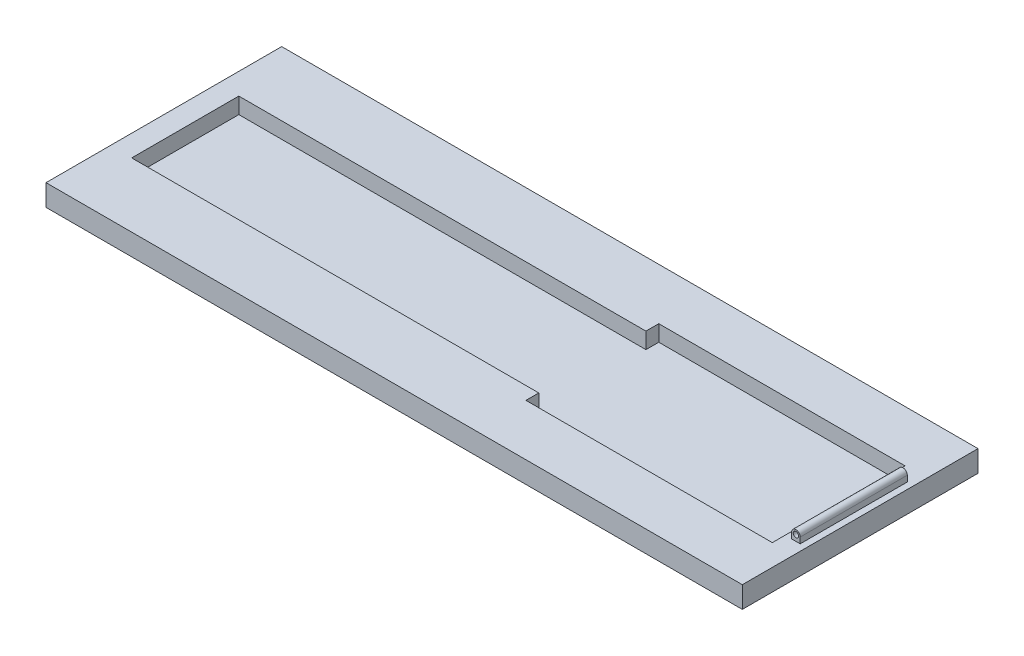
ISO-10303-21;
HEADER;
FILE_DESCRIPTION(('STEP AP214'),'2;1');
FILE_NAME('part.step','',(''),(''),'','','');
FILE_SCHEMA(('AUTOMOTIVE_DESIGN { 1 0 10303 214 1 1 1 1 }'));
ENDSEC;
DATA;
#1=APPLICATION_CONTEXT('core data for automotive mechanical design processes');
#2=APPLICATION_PROTOCOL_DEFINITION('international standard','automotive_design',2000,#1);
#3=PRODUCT_CONTEXT('',#1,'mechanical');
#4=PRODUCT('Part','Part','',(#3));
#5=PRODUCT_RELATED_PRODUCT_CATEGORY('part','',(#4));
#6=PRODUCT_DEFINITION_FORMATION('','',#4);
#7=PRODUCT_DEFINITION_CONTEXT('part definition',#1,'design');
#8=PRODUCT_DEFINITION('design','',#6,#7);
#9=PRODUCT_DEFINITION_SHAPE('','',#8);
#10=(LENGTH_UNIT() NAMED_UNIT(*) SI_UNIT(.MILLI.,.METRE.));
#11=(NAMED_UNIT(*) PLANE_ANGLE_UNIT() SI_UNIT($,.RADIAN.));
#12=(NAMED_UNIT(*) SI_UNIT($,.STERADIAN.) SOLID_ANGLE_UNIT());
#13=UNCERTAINTY_MEASURE_WITH_UNIT(LENGTH_MEASURE(1.E-05),#10,'distance_accuracy_value','');
#14=(GEOMETRIC_REPRESENTATION_CONTEXT(3) GLOBAL_UNCERTAINTY_ASSIGNED_CONTEXT((#13)) GLOBAL_UNIT_ASSIGNED_CONTEXT((#10,
#11,#12)) REPRESENTATION_CONTEXT('',''));
#15=CARTESIAN_POINT('',(0.,0.,0.));
#16=DIRECTION('',(0.,0.,1.));
#17=DIRECTION('',(1.,0.,0.));
#18=AXIS2_PLACEMENT_3D('',#15,#16,#17);
#19=CARTESIAN_POINT('',(-6400.,-55.,1100.));
#20=DIRECTION('',(0.,-1.,0.));
#21=DIRECTION('',(0.,0.,-1.));
#22=AXIS2_PLACEMENT_3D('',#19,#20,#21);
#23=PLANE('',#22);
#24=DIRECTION('',(-1.,0.,0.));
#25=VECTOR('',#24,1.);
#26=CARTESIAN_POINT('',(-2400.,-55.,-500.));
#27=LINE('',#26,#25);
#28=CARTESIAN_POINT('',(-2400.,-55.,-500.));
#29=VERTEX_POINT('',#28);
#30=CARTESIAN_POINT('',(-6200.,-55.,-500.));
#31=VERTEX_POINT('',#30);
#32=EDGE_CURVE('E191',#29,#31,#27,.T.);
#33=ORIENTED_EDGE('',*,*,#32,.F.);
#34=DIRECTION('',(0.,0.,1.));
#35=VECTOR('',#34,1.);
#36=CARTESIAN_POINT('',(-2400.,-55.,-620.));
#37=LINE('',#36,#35);
#38=CARTESIAN_POINT('',(-2400.,-55.,-620.));
#39=VERTEX_POINT('',#38);
#40=EDGE_CURVE('E52',#39,#29,#37,.T.);
#41=ORIENTED_EDGE('',*,*,#40,.F.);
#42=DIRECTION('',(-1.,0.,0.));
#43=VECTOR('',#42,1.);
#44=CARTESIAN_POINT('',(-2400.,-55.,-620.));
#45=LINE('',#44,#43);
#46=CARTESIAN_POINT('',(-100.,-55.,-620.));
#47=VERTEX_POINT('',#46);
#48=EDGE_CURVE('E171',#47,#39,#45,.T.);
#49=ORIENTED_EDGE('',*,*,#48,.F.);
#50=DIRECTION('',(0.,0.,-1.));
#51=VECTOR('',#50,1.);
#52=CARTESIAN_POINT('',(-100.,-55.,-620.));
#53=LINE('',#52,#51);
#54=CARTESIAN_POINT('',(-100.,-55.,620.));
#55=VERTEX_POINT('',#54);
#56=EDGE_CURVE('E174',#55,#47,#53,.T.);
#57=ORIENTED_EDGE('',*,*,#56,.F.);
#58=DIRECTION('',(1.,0.,0.));
#59=VECTOR('',#58,1.);
#60=CARTESIAN_POINT('',(-2400.,-55.,620.));
#61=LINE('',#60,#59);
#62=CARTESIAN_POINT('',(-2400.,-55.,620.));
#63=VERTEX_POINT('',#62);
#64=EDGE_CURVE('E202',#63,#55,#61,.T.);
#65=ORIENTED_EDGE('',*,*,#64,.F.);
#66=DIRECTION('',(0.,0.,1.));
#67=VECTOR('',#66,1.);
#68=CARTESIAN_POINT('',(-2400.,-55.,500.));
#69=LINE('',#68,#67);
#70=CARTESIAN_POINT('',(-2400.,-55.,500.));
#71=VERTEX_POINT('',#70);
#72=EDGE_CURVE('E199',#71,#63,#69,.T.);
#73=ORIENTED_EDGE('',*,*,#72,.F.);
#74=DIRECTION('',(1.,0.,0.));
#75=VECTOR('',#74,1.);
#76=CARTESIAN_POINT('',(-2400.,-55.,500.));
#77=LINE('',#76,#75);
#78=CARTESIAN_POINT('',(-6200.,-55.,500.000000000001));
#79=VERTEX_POINT('',#78);
#80=EDGE_CURVE('E196',#79,#71,#77,.T.);
#81=ORIENTED_EDGE('',*,*,#80,.F.);
#82=DIRECTION('',(0.,0.,1.));
#83=VECTOR('',#82,1.);
#84=CARTESIAN_POINT('',(-6200.,-55.,-500.));
#85=LINE('',#84,#83);
#86=EDGE_CURVE('E193',#31,#79,#85,.T.);
#87=ORIENTED_EDGE('',*,*,#86,.F.);
#88=EDGE_LOOP('',(#33,#41,#49,#57,#65,#73,#81,#87));
#89=FACE_BOUND('',#88,.T.);
#90=DIRECTION('',(-1.,0.,0.));
#91=VECTOR('',#90,1.);
#92=CARTESIAN_POINT('',(-6400.,-55.,-1100.));
#93=LINE('',#92,#91);
#94=CARTESIAN_POINT('',(100.,-55.,-1100.));
#95=VERTEX_POINT('',#94);
#96=CARTESIAN_POINT('',(-6400.,-55.,-1100.));
#97=VERTEX_POINT('',#96);
#98=EDGE_CURVE('E260',#95,#97,#93,.T.);
#99=ORIENTED_EDGE('',*,*,#98,.T.);
#100=DIRECTION('',(0.,0.,-1.));
#101=VECTOR('',#100,1.);
#102=CARTESIAN_POINT('',(-6400.,-55.,1100.));
#103=LINE('',#102,#101);
#104=CARTESIAN_POINT('',(-6400.,-55.,1100.));
#105=VERTEX_POINT('',#104);
#106=EDGE_CURVE('E266',#105,#97,#103,.T.);
#107=ORIENTED_EDGE('',*,*,#106,.F.);
#108=DIRECTION('',(-1.,0.,0.));
#109=VECTOR('',#108,1.);
#110=CARTESIAN_POINT('',(-6400.,-55.,1100.));
#111=LINE('',#110,#109);
#112=CARTESIAN_POINT('',(100.,-55.,1100.));
#113=VERTEX_POINT('',#112);
#114=EDGE_CURVE('E264',#113,#105,#111,.T.);
#115=ORIENTED_EDGE('',*,*,#114,.F.);
#116=DIRECTION('',(0.,0.,-1.));
#117=VECTOR('',#116,1.);
#118=CARTESIAN_POINT('',(100.,-55.,1100.));
#119=LINE('',#118,#117);
#120=EDGE_CURVE('E276',#113,#95,#119,.T.);
#121=ORIENTED_EDGE('',*,*,#120,.T.);
#122=EDGE_LOOP('',(#99,#107,#115,#121));
#123=FACE_BOUND('',#122,.T.);
#124=DIRECTION('',(0.,0.,-1.));
#125=VECTOR('',#124,1.);
#126=CARTESIAN_POINT('',(-40.,-55.,500.));
#127=LINE('',#126,#125);
#128=CARTESIAN_POINT('',(-40.,-55.,500.));
#129=VERTEX_POINT('',#128);
#130=CARTESIAN_POINT('',(-40.,-55.,-500.));
#131=VERTEX_POINT('',#130);
#132=EDGE_CURVE('E250',#129,#131,#127,.T.);
#133=ORIENTED_EDGE('',*,*,#132,.T.);
#134=DIRECTION('',(1.,0.,0.));
#135=VECTOR('',#134,1.);
#136=CARTESIAN_POINT('',(-40.,-55.,-500.));
#137=LINE('',#136,#135);
#138=CARTESIAN_POINT('',(40.,-55.,-500.));
#139=VERTEX_POINT('',#138);
#140=EDGE_CURVE('E242',#131,#139,#137,.T.);
#141=ORIENTED_EDGE('',*,*,#140,.T.);
#142=DIRECTION('',(0.,0.,-1.));
#143=VECTOR('',#142,1.);
#144=CARTESIAN_POINT('',(40.,-55.,500.));
#145=LINE('',#144,#143);
#146=CARTESIAN_POINT('',(40.,-55.,500.));
#147=VERTEX_POINT('',#146);
#148=EDGE_CURVE('E247',#147,#139,#145,.T.);
#149=ORIENTED_EDGE('',*,*,#148,.F.);
#150=DIRECTION('',(1.,0.,0.));
#151=VECTOR('',#150,1.);
#152=CARTESIAN_POINT('',(-40.,-55.,500.));
#153=LINE('',#152,#151);
#154=EDGE_CURVE('E60',#129,#147,#153,.T.);
#155=ORIENTED_EDGE('',*,*,#154,.F.);
#156=EDGE_LOOP('',(#133,#141,#149,#155));
#157=FACE_BOUND('',#156,.T.);
#158=ADVANCED_FACE('F37',(#89,#123,#157),#23,.F.);
#159=CARTESIAN_POINT('',(-6400.,-55.,1100.));
#160=DIRECTION('',(1.,0.,0.));
#161=DIRECTION('',(0.,0.,-1.));
#162=AXIS2_PLACEMENT_3D('',#159,#160,#161);
#163=PLANE('',#162);
#164=DIRECTION('',(0.,-1.,0.));
#165=VECTOR('',#164,1.);
#166=CARTESIAN_POINT('',(-6400.,-55.,-1100.));
#167=LINE('',#166,#165);
#168=CARTESIAN_POINT('',(-6400.,-255.,-1100.));
#169=VERTEX_POINT('',#168);
#170=EDGE_CURVE('E255',#97,#169,#167,.T.);
#171=ORIENTED_EDGE('',*,*,#170,.T.);
#172=DIRECTION('',(0.,0.,-1.));
#173=VECTOR('',#172,1.);
#174=CARTESIAN_POINT('',(-6400.,-255.,1100.));
#175=LINE('',#174,#173);
#176=CARTESIAN_POINT('',(-6400.,-255.,1100.));
#177=VERTEX_POINT('',#176);
#178=EDGE_CURVE('E11',#177,#169,#175,.T.);
#179=ORIENTED_EDGE('',*,*,#178,.F.);
#180=DIRECTION('',(0.,-1.,0.));
#181=VECTOR('',#180,1.);
#182=CARTESIAN_POINT('',(-6400.,-55.,1100.));
#183=LINE('',#182,#181);
#184=EDGE_CURVE('E256',#105,#177,#183,.T.);
#185=ORIENTED_EDGE('',*,*,#184,.F.);
#186=ORIENTED_EDGE('',*,*,#106,.T.);
#187=EDGE_LOOP('',(#171,#179,#185,#186));
#188=FACE_BOUND('',#187,.T.);
#189=ADVANCED_FACE('F39',(#188),#163,.F.);
#190=CARTESIAN_POINT('',(-6400.,-255.,1100.));
#191=DIRECTION('',(0.,1.,0.));
#192=DIRECTION('',(0.,0.,1.));
#193=AXIS2_PLACEMENT_3D('',#190,#191,#192);
#194=PLANE('',#193);
#195=DIRECTION('',(1.,0.,0.));
#196=VECTOR('',#195,1.);
#197=CARTESIAN_POINT('',(-6400.,-255.,-1100.));
#198=LINE('',#197,#196);
#199=CARTESIAN_POINT('',(100.,-255.,-1100.));
#200=VERTEX_POINT('',#199);
#201=EDGE_CURVE('E269',#169,#200,#198,.T.);
#202=ORIENTED_EDGE('',*,*,#201,.T.);
#203=DIRECTION('',(0.,0.,-1.));
#204=VECTOR('',#203,1.);
#205=CARTESIAN_POINT('',(100.,-255.,1100.));
#206=LINE('',#205,#204);
#207=CARTESIAN_POINT('',(100.,-255.,1100.));
#208=VERTEX_POINT('',#207);
#209=EDGE_CURVE('E45',#208,#200,#206,.T.);
#210=ORIENTED_EDGE('',*,*,#209,.F.);
#211=DIRECTION('',(1.,0.,0.));
#212=VECTOR('',#211,1.);
#213=CARTESIAN_POINT('',(-6400.,-255.,1100.));
#214=LINE('',#213,#212);
#215=EDGE_CURVE('E259',#177,#208,#214,.T.);
#216=ORIENTED_EDGE('',*,*,#215,.F.);
#217=ORIENTED_EDGE('',*,*,#178,.T.);
#218=EDGE_LOOP('',(#202,#210,#216,#217));
#219=FACE_BOUND('',#218,.T.);
#220=ADVANCED_FACE('F298',(#219),#194,.F.);
#221=CARTESIAN_POINT('',(100.,-55.,1100.));
#222=DIRECTION('',(-1.,0.,0.));
#223=DIRECTION('',(0.,-1.,0.));
#224=AXIS2_PLACEMENT_3D('',#221,#222,#223);
#225=PLANE('',#224);
#226=DIRECTION('',(0.,1.,0.));
#227=VECTOR('',#226,1.);
#228=CARTESIAN_POINT('',(100.,-55.,-1100.));
#229=LINE('',#228,#227);
#230=EDGE_CURVE('E271',#200,#95,#229,.T.);
#231=ORIENTED_EDGE('',*,*,#230,.T.);
#232=ORIENTED_EDGE('',*,*,#120,.F.);
#233=DIRECTION('',(0.,1.,0.));
#234=VECTOR('',#233,1.);
#235=CARTESIAN_POINT('',(100.,-55.,1100.));
#236=LINE('',#235,#234);
#237=EDGE_CURVE('E262',#208,#113,#236,.T.);
#238=ORIENTED_EDGE('',*,*,#237,.F.);
#239=ORIENTED_EDGE('',*,*,#209,.T.);
#240=EDGE_LOOP('',(#231,#232,#238,#239));
#241=FACE_BOUND('',#240,.T.);
#242=ADVANCED_FACE('F283',(#241),#225,.F.);
#243=CARTESIAN_POINT('',(-6400.,-255.,1100.));
#244=DIRECTION('',(0.,0.,1.));
#245=DIRECTION('',(1.,0.,0.));
#246=AXIS2_PLACEMENT_3D('',#243,#244,#245);
#247=PLANE('',#246);
#248=ORIENTED_EDGE('',*,*,#184,.T.);
#249=ORIENTED_EDGE('',*,*,#215,.T.);
#250=ORIENTED_EDGE('',*,*,#237,.T.);
#251=ORIENTED_EDGE('',*,*,#114,.T.);
#252=EDGE_LOOP('',(#248,#249,#250,#251));
#253=FACE_BOUND('',#252,.T.);
#254=ADVANCED_FACE('F297',(#253),#247,.T.);
#255=CARTESIAN_POINT('',(-6400.,-255.,-1100.));
#256=DIRECTION('',(0.,0.,1.));
#257=DIRECTION('',(1.,0.,0.));
#258=AXIS2_PLACEMENT_3D('',#255,#256,#257);
#259=PLANE('',#258);
#260=ORIENTED_EDGE('',*,*,#170,.F.);
#261=ORIENTED_EDGE('',*,*,#98,.F.);
#262=ORIENTED_EDGE('',*,*,#230,.F.);
#263=ORIENTED_EDGE('',*,*,#201,.F.);
#264=EDGE_LOOP('',(#260,#261,#262,#263));
#265=FACE_BOUND('',#264,.T.);
#266=ADVANCED_FACE('F289',(#265),#259,.F.);
#267=CARTESIAN_POINT('',(0.,0.,500.));
#268=DIRECTION('',(0.,0.,1.));
#269=DIRECTION('',(1.,0.,0.));
#270=AXIS2_PLACEMENT_3D('',#267,#268,#269);
#271=PLANE('',#270);
#272=CARTESIAN_POINT('',(0.,0.,500.));
#273=DIRECTION('',(0.,0.,1.));
#274=DIRECTION('',(1.,0.,0.));
#275=AXIS2_PLACEMENT_3D('',#272,#273,#274);
#276=CIRCLE('',#275,40.);
#277=CARTESIAN_POINT('',(40.,0.,500.));
#278=VERTEX_POINT('',#277);
#279=CARTESIAN_POINT('',(-40.,0.,500.));
#280=VERTEX_POINT('',#279);
#281=EDGE_CURVE('E227',#278,#280,#276,.T.);
#282=ORIENTED_EDGE('',*,*,#281,.T.);
#283=DIRECTION('',(0.,-1.,0.));
#284=VECTOR('',#283,1.);
#285=CARTESIAN_POINT('',(-40.,0.,500.));
#286=LINE('',#285,#284);
#287=EDGE_CURVE('E230',#280,#129,#286,.T.);
#288=ORIENTED_EDGE('',*,*,#287,.T.);
#289=ORIENTED_EDGE('',*,*,#154,.T.);
#290=DIRECTION('',(0.,1.,0.));
#291=VECTOR('',#290,1.);
#292=CARTESIAN_POINT('',(40.,-55.,500.));
#293=LINE('',#292,#291);
#294=EDGE_CURVE('E234',#147,#278,#293,.T.);
#295=ORIENTED_EDGE('',*,*,#294,.T.);
#296=EDGE_LOOP('',(#282,#288,#289,#295));
#297=FACE_BOUND('',#296,.T.);
#298=CARTESIAN_POINT('',(0.,0.,500.));
#299=DIRECTION('',(0.,0.,1.));
#300=DIRECTION('',(1.,0.,0.));
#301=AXIS2_PLACEMENT_3D('',#298,#299,#300);
#302=CIRCLE('',#301,25.);
#303=CARTESIAN_POINT('',(25.,0.,500.));
#304=VERTEX_POINT('',#303);
#305=EDGE_CURVE('E221',#304,#304,#302,.T.);
#306=ORIENTED_EDGE('',*,*,#305,.F.);
#307=EDGE_LOOP('',(#306));
#308=FACE_BOUND('',#307,.T.);
#309=ADVANCED_FACE('F313',(#297,#308),#271,.T.);
#310=CARTESIAN_POINT('',(0.,0.,-500.));
#311=DIRECTION('',(0.,0.,1.));
#312=DIRECTION('',(1.,0.,0.));
#313=AXIS2_PLACEMENT_3D('',#310,#311,#312);
#314=PLANE('',#313);
#315=CARTESIAN_POINT('',(0.,0.,-500.));
#316=DIRECTION('',(0.,0.,1.));
#317=DIRECTION('',(1.,0.,0.));
#318=AXIS2_PLACEMENT_3D('',#315,#316,#317);
#319=CIRCLE('',#318,40.);
#320=CARTESIAN_POINT('',(40.,0.,-500.));
#321=VERTEX_POINT('',#320);
#322=CARTESIAN_POINT('',(-40.,0.,-500.));
#323=VERTEX_POINT('',#322);
#324=EDGE_CURVE('E224',#321,#323,#319,.T.);
#325=ORIENTED_EDGE('',*,*,#324,.F.);
#326=DIRECTION('',(0.,1.,0.));
#327=VECTOR('',#326,1.);
#328=CARTESIAN_POINT('',(40.,-55.,-500.));
#329=LINE('',#328,#327);
#330=EDGE_CURVE('E231',#139,#321,#329,.T.);
#331=ORIENTED_EDGE('',*,*,#330,.F.);
#332=ORIENTED_EDGE('',*,*,#140,.F.);
#333=DIRECTION('',(0.,-1.,0.));
#334=VECTOR('',#333,1.);
#335=CARTESIAN_POINT('',(-40.,0.,-500.));
#336=LINE('',#335,#334);
#337=EDGE_CURVE('E239',#323,#131,#336,.T.);
#338=ORIENTED_EDGE('',*,*,#337,.F.);
#339=EDGE_LOOP('',(#325,#331,#332,#338));
#340=FACE_BOUND('',#339,.T.);
#341=CARTESIAN_POINT('',(0.,0.,-500.));
#342=DIRECTION('',(0.,0.,1.));
#343=DIRECTION('',(1.,0.,0.));
#344=AXIS2_PLACEMENT_3D('',#341,#342,#343);
#345=CIRCLE('',#344,25.);
#346=CARTESIAN_POINT('',(25.,0.,-500.));
#347=VERTEX_POINT('',#346);
#348=EDGE_CURVE('E209',#347,#347,#345,.T.);
#349=ORIENTED_EDGE('',*,*,#348,.T.);
#350=EDGE_LOOP('',(#349));
#351=FACE_BOUND('',#350,.T.);
#352=ADVANCED_FACE('F320',(#340,#351),#314,.F.);
#353=CARTESIAN_POINT('',(0.,0.,500.));
#354=DIRECTION('',(0.,0.,-1.));
#355=DIRECTION('',(-1.,0.,0.));
#356=AXIS2_PLACEMENT_3D('',#353,#354,#355);
#357=CYLINDRICAL_SURFACE('',#356,40.);
#358=ORIENTED_EDGE('',*,*,#324,.T.);
#359=DIRECTION('',(0.,0.,-1.));
#360=VECTOR('',#359,1.);
#361=CARTESIAN_POINT('',(-40.,0.,500.));
#362=LINE('',#361,#360);
#363=EDGE_CURVE('E252',#280,#323,#362,.T.);
#364=ORIENTED_EDGE('',*,*,#363,.F.);
#365=ORIENTED_EDGE('',*,*,#281,.F.);
#366=DIRECTION('',(0.,0.,-1.));
#367=VECTOR('',#366,1.);
#368=CARTESIAN_POINT('',(40.,0.,500.));
#369=LINE('',#368,#367);
#370=EDGE_CURVE('E236',#278,#321,#369,.T.);
#371=ORIENTED_EDGE('',*,*,#370,.T.);
#372=EDGE_LOOP('',(#358,#364,#365,#371));
#373=FACE_BOUND('',#372,.T.);
#374=ADVANCED_FACE('F316',(#373),#357,.T.);
#375=CARTESIAN_POINT('',(-40.,0.,500.));
#376=DIRECTION('',(1.,0.,0.));
#377=DIRECTION('',(0.,1.,0.));
#378=AXIS2_PLACEMENT_3D('',#375,#376,#377);
#379=PLANE('',#378);
#380=ORIENTED_EDGE('',*,*,#337,.T.);
#381=ORIENTED_EDGE('',*,*,#132,.F.);
#382=ORIENTED_EDGE('',*,*,#287,.F.);
#383=ORIENTED_EDGE('',*,*,#363,.T.);
#384=EDGE_LOOP('',(#380,#381,#382,#383));
#385=FACE_BOUND('',#384,.T.);
#386=ADVANCED_FACE('F319',(#385),#379,.F.);
#387=CARTESIAN_POINT('',(40.,-55.,500.));
#388=DIRECTION('',(-1.,0.,0.));
#389=DIRECTION('',(0.,0.,1.));
#390=AXIS2_PLACEMENT_3D('',#387,#388,#389);
#391=PLANE('',#390);
#392=ORIENTED_EDGE('',*,*,#330,.T.);
#393=ORIENTED_EDGE('',*,*,#370,.F.);
#394=ORIENTED_EDGE('',*,*,#294,.F.);
#395=ORIENTED_EDGE('',*,*,#148,.T.);
#396=EDGE_LOOP('',(#392,#393,#394,#395));
#397=FACE_BOUND('',#396,.T.);
#398=ADVANCED_FACE('F324',(#397),#391,.F.);
#399=CARTESIAN_POINT('',(0.,0.,500.));
#400=DIRECTION('',(0.,0.,-1.));
#401=DIRECTION('',(-1.,0.,0.));
#402=AXIS2_PLACEMENT_3D('',#399,#400,#401);
#403=CYLINDRICAL_SURFACE('',#402,25.);
#404=ORIENTED_EDGE('',*,*,#305,.T.);
#405=EDGE_LOOP('',(#404));
#406=FACE_BOUND('',#405,.T.);
#407=ORIENTED_EDGE('',*,*,#348,.F.);
#408=EDGE_LOOP('',(#407));
#409=FACE_BOUND('',#408,.T.);
#410=ADVANCED_FACE('F328',(#406,#409),#403,.F.);
#411=CARTESIAN_POINT('',(-2400.,-205.,-620.));
#412=DIRECTION('',(-1.,0.,0.));
#413=DIRECTION('',(0.,0.,1.));
#414=AXIS2_PLACEMENT_3D('',#411,#412,#413);
#415=PLANE('',#414);
#416=ORIENTED_EDGE('',*,*,#40,.T.);
#417=DIRECTION('',(0.,1.,0.));
#418=VECTOR('',#417,1.);
#419=CARTESIAN_POINT('',(-2400.,-205.,-500.));
#420=LINE('',#419,#418);
#421=CARTESIAN_POINT('',(-2400.,-205.,-500.));
#422=VERTEX_POINT('',#421);
#423=EDGE_CURVE('E148',#422,#29,#420,.T.);
#424=ORIENTED_EDGE('',*,*,#423,.F.);
#425=DIRECTION('',(0.,0.,1.));
#426=VECTOR('',#425,1.);
#427=CARTESIAN_POINT('',(-2400.,-205.,-620.));
#428=LINE('',#427,#426);
#429=CARTESIAN_POINT('',(-2400.,-205.,-620.));
#430=VERTEX_POINT('',#429);
#431=EDGE_CURVE('E152',#430,#422,#428,.T.);
#432=ORIENTED_EDGE('',*,*,#431,.F.);
#433=DIRECTION('',(0.,1.,0.));
#434=VECTOR('',#433,1.);
#435=CARTESIAN_POINT('',(-2400.,-205.,-620.));
#436=LINE('',#435,#434);
#437=EDGE_CURVE('E207',#430,#39,#436,.T.);
#438=ORIENTED_EDGE('',*,*,#437,.T.);
#439=EDGE_LOOP('',(#416,#424,#432,#438));
#440=FACE_BOUND('',#439,.T.);
#441=ADVANCED_FACE('F150',(#440),#415,.F.);
#442=CARTESIAN_POINT('',(-2400.,-205.,-620.));
#443=DIRECTION('',(0.,0.,-1.));
#444=DIRECTION('',(-1.,0.,0.));
#445=AXIS2_PLACEMENT_3D('',#442,#443,#444);
#446=PLANE('',#445);
#447=ORIENTED_EDGE('',*,*,#48,.T.);
#448=ORIENTED_EDGE('',*,*,#437,.F.);
#449=DIRECTION('',(-1.,0.,0.));
#450=VECTOR('',#449,1.);
#451=CARTESIAN_POINT('',(-2400.,-205.,-620.));
#452=LINE('',#451,#450);
#453=CARTESIAN_POINT('',(-100.,-205.,-620.));
#454=VERTEX_POINT('',#453);
#455=EDGE_CURVE('E158',#454,#430,#452,.T.);
#456=ORIENTED_EDGE('',*,*,#455,.F.);
#457=DIRECTION('',(0.,1.,0.));
#458=VECTOR('',#457,1.);
#459=CARTESIAN_POINT('',(-100.,-205.,-620.));
#460=LINE('',#459,#458);
#461=EDGE_CURVE('E210',#454,#47,#460,.T.);
#462=ORIENTED_EDGE('',*,*,#461,.T.);
#463=EDGE_LOOP('',(#447,#448,#456,#462));
#464=FACE_BOUND('',#463,.T.);
#465=ADVANCED_FACE('F341',(#464),#446,.F.);
#466=CARTESIAN_POINT('',(-100.,-205.,-620.));
#467=DIRECTION('',(1.,0.,0.));
#468=DIRECTION('',(0.,0.,-1.));
#469=AXIS2_PLACEMENT_3D('',#466,#467,#468);
#470=PLANE('',#469);
#471=ORIENTED_EDGE('',*,*,#56,.T.);
#472=ORIENTED_EDGE('',*,*,#461,.F.);
#473=DIRECTION('',(0.,0.,-1.));
#474=VECTOR('',#473,1.);
#475=CARTESIAN_POINT('',(-100.,-205.,-620.));
#476=LINE('',#475,#474);
#477=CARTESIAN_POINT('',(-100.,-205.,620.));
#478=VERTEX_POINT('',#477);
#479=EDGE_CURVE('E187',#478,#454,#476,.T.);
#480=ORIENTED_EDGE('',*,*,#479,.F.);
#481=DIRECTION('',(0.,1.,0.));
#482=VECTOR('',#481,1.);
#483=CARTESIAN_POINT('',(-100.,-205.,620.));
#484=LINE('',#483,#482);
#485=EDGE_CURVE('E212',#478,#55,#484,.T.);
#486=ORIENTED_EDGE('',*,*,#485,.T.);
#487=EDGE_LOOP('',(#471,#472,#480,#486));
#488=FACE_BOUND('',#487,.T.);
#489=ADVANCED_FACE('F359',(#488),#470,.F.);
#490=CARTESIAN_POINT('',(-2400.,-205.,620.));
#491=DIRECTION('',(0.,0.,1.));
#492=DIRECTION('',(1.,0.,0.));
#493=AXIS2_PLACEMENT_3D('',#490,#491,#492);
#494=PLANE('',#493);
#495=ORIENTED_EDGE('',*,*,#64,.T.);
#496=ORIENTED_EDGE('',*,*,#485,.F.);
#497=DIRECTION('',(1.,0.,0.));
#498=VECTOR('',#497,1.);
#499=CARTESIAN_POINT('',(-2400.,-205.,620.));
#500=LINE('',#499,#498);
#501=CARTESIAN_POINT('',(-2400.,-205.,620.));
#502=VERTEX_POINT('',#501);
#503=EDGE_CURVE('E184',#502,#478,#500,.T.);
#504=ORIENTED_EDGE('',*,*,#503,.F.);
#505=DIRECTION('',(0.,1.,0.));
#506=VECTOR('',#505,1.);
#507=CARTESIAN_POINT('',(-2400.,-205.,620.));
#508=LINE('',#507,#506);
#509=EDGE_CURVE('E214',#502,#63,#508,.T.);
#510=ORIENTED_EDGE('',*,*,#509,.T.);
#511=EDGE_LOOP('',(#495,#496,#504,#510));
#512=FACE_BOUND('',#511,.T.);
#513=ADVANCED_FACE('F355',(#512),#494,.F.);
#514=CARTESIAN_POINT('',(-2400.,-205.,500.));
#515=DIRECTION('',(-1.,0.,0.));
#516=DIRECTION('',(0.,0.,1.));
#517=AXIS2_PLACEMENT_3D('',#514,#515,#516);
#518=PLANE('',#517);
#519=ORIENTED_EDGE('',*,*,#72,.T.);
#520=ORIENTED_EDGE('',*,*,#509,.F.);
#521=DIRECTION('',(0.,0.,1.));
#522=VECTOR('',#521,1.);
#523=CARTESIAN_POINT('',(-2400.,-205.,500.));
#524=LINE('',#523,#522);
#525=CARTESIAN_POINT('',(-2400.,-205.,500.));
#526=VERTEX_POINT('',#525);
#527=EDGE_CURVE('E181',#526,#502,#524,.T.);
#528=ORIENTED_EDGE('',*,*,#527,.F.);
#529=DIRECTION('',(0.,1.,0.));
#530=VECTOR('',#529,1.);
#531=CARTESIAN_POINT('',(-2400.,-205.,500.));
#532=LINE('',#531,#530);
#533=EDGE_CURVE('E216',#526,#71,#532,.T.);
#534=ORIENTED_EDGE('',*,*,#533,.T.);
#535=EDGE_LOOP('',(#519,#520,#528,#534));
#536=FACE_BOUND('',#535,.T.);
#537=ADVANCED_FACE('F351',(#536),#518,.F.);
#538=CARTESIAN_POINT('',(-2400.,-205.,500.));
#539=DIRECTION('',(0.,0.,1.));
#540=DIRECTION('',(1.,0.,0.));
#541=AXIS2_PLACEMENT_3D('',#538,#539,#540);
#542=PLANE('',#541);
#543=ORIENTED_EDGE('',*,*,#80,.T.);
#544=ORIENTED_EDGE('',*,*,#533,.F.);
#545=DIRECTION('',(1.,0.,0.));
#546=VECTOR('',#545,1.);
#547=CARTESIAN_POINT('',(-2400.,-205.,500.));
#548=LINE('',#547,#546);
#549=CARTESIAN_POINT('',(-6200.,-205.,500.000000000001));
#550=VERTEX_POINT('',#549);
#551=EDGE_CURVE('E178',#550,#526,#548,.T.);
#552=ORIENTED_EDGE('',*,*,#551,.F.);
#553=DIRECTION('',(0.,1.,0.));
#554=VECTOR('',#553,1.);
#555=CARTESIAN_POINT('',(-6200.,-205.,500.000000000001));
#556=LINE('',#555,#554);
#557=EDGE_CURVE('E218',#550,#79,#556,.T.);
#558=ORIENTED_EDGE('',*,*,#557,.T.);
#559=EDGE_LOOP('',(#543,#544,#552,#558));
#560=FACE_BOUND('',#559,.T.);
#561=ADVANCED_FACE('F347',(#560),#542,.F.);
#562=CARTESIAN_POINT('',(-6200.,-205.,-500.));
#563=DIRECTION('',(-1.,0.,0.));
#564=DIRECTION('',(0.,0.,1.));
#565=AXIS2_PLACEMENT_3D('',#562,#563,#564);
#566=PLANE('',#565);
#567=ORIENTED_EDGE('',*,*,#86,.T.);
#568=ORIENTED_EDGE('',*,*,#557,.F.);
#569=DIRECTION('',(0.,0.,1.));
#570=VECTOR('',#569,1.);
#571=CARTESIAN_POINT('',(-6200.,-205.,-500.));
#572=LINE('',#571,#570);
#573=CARTESIAN_POINT('',(-6200.,-205.,-500.));
#574=VERTEX_POINT('',#573);
#575=EDGE_CURVE('E166',#574,#550,#572,.T.);
#576=ORIENTED_EDGE('',*,*,#575,.F.);
#577=DIRECTION('',(0.,1.,0.));
#578=VECTOR('',#577,1.);
#579=CARTESIAN_POINT('',(-6200.,-205.,-500.));
#580=LINE('',#579,#578);
#581=EDGE_CURVE('E157',#574,#31,#580,.T.);
#582=ORIENTED_EDGE('',*,*,#581,.T.);
#583=EDGE_LOOP('',(#567,#568,#576,#582));
#584=FACE_BOUND('',#583,.T.);
#585=ADVANCED_FACE('F344',(#584),#566,.F.);
#586=CARTESIAN_POINT('',(-2400.,-205.,-500.));
#587=DIRECTION('',(0.,0.,-1.));
#588=DIRECTION('',(-1.,0.,0.));
#589=AXIS2_PLACEMENT_3D('',#586,#587,#588);
#590=PLANE('',#589);
#591=ORIENTED_EDGE('',*,*,#32,.T.);
#592=ORIENTED_EDGE('',*,*,#581,.F.);
#593=DIRECTION('',(-1.,0.,0.));
#594=VECTOR('',#593,1.);
#595=CARTESIAN_POINT('',(-2400.,-205.,-500.));
#596=LINE('',#595,#594);
#597=EDGE_CURVE('E161',#422,#574,#596,.T.);
#598=ORIENTED_EDGE('',*,*,#597,.F.);
#599=ORIENTED_EDGE('',*,*,#423,.T.);
#600=EDGE_LOOP('',(#591,#592,#598,#599));
#601=FACE_BOUND('',#600,.T.);
#602=ADVANCED_FACE('F162',(#601),#590,.F.);
#603=CARTESIAN_POINT('',(-2400.,-205.,620.));
#604=DIRECTION('',(0.,1.,0.));
#605=DIRECTION('',(0.,0.,1.));
#606=AXIS2_PLACEMENT_3D('',#603,#604,#605);
#607=PLANE('',#606);
#608=ORIENTED_EDGE('',*,*,#431,.T.);
#609=ORIENTED_EDGE('',*,*,#597,.T.);
#610=ORIENTED_EDGE('',*,*,#575,.T.);
#611=ORIENTED_EDGE('',*,*,#551,.T.);
#612=ORIENTED_EDGE('',*,*,#527,.T.);
#613=ORIENTED_EDGE('',*,*,#503,.T.);
#614=ORIENTED_EDGE('',*,*,#479,.T.);
#615=ORIENTED_EDGE('',*,*,#455,.T.);
#616=EDGE_LOOP('',(#608,#609,#610,#611,#612,#613,#614,#615));
#617=FACE_BOUND('',#616,.T.);
#618=ADVANCED_FACE('F168',(#617),#607,.T.);
#619=CLOSED_SHELL('',(#158,#189,#220,#242,#254,#266,#309,#352,#374,#386,#398,#410,#441,#465,
#489,#513,#537,#561,#585,#602,#618));
#620=MANIFOLD_SOLID_BREP('B2',#619);
#621=ADVANCED_BREP_SHAPE_REPRESENTATION('',(#18,#620),#14);
#622=SHAPE_DEFINITION_REPRESENTATION(#9,#621);
ENDSEC;
END-ISO-10303-21;
